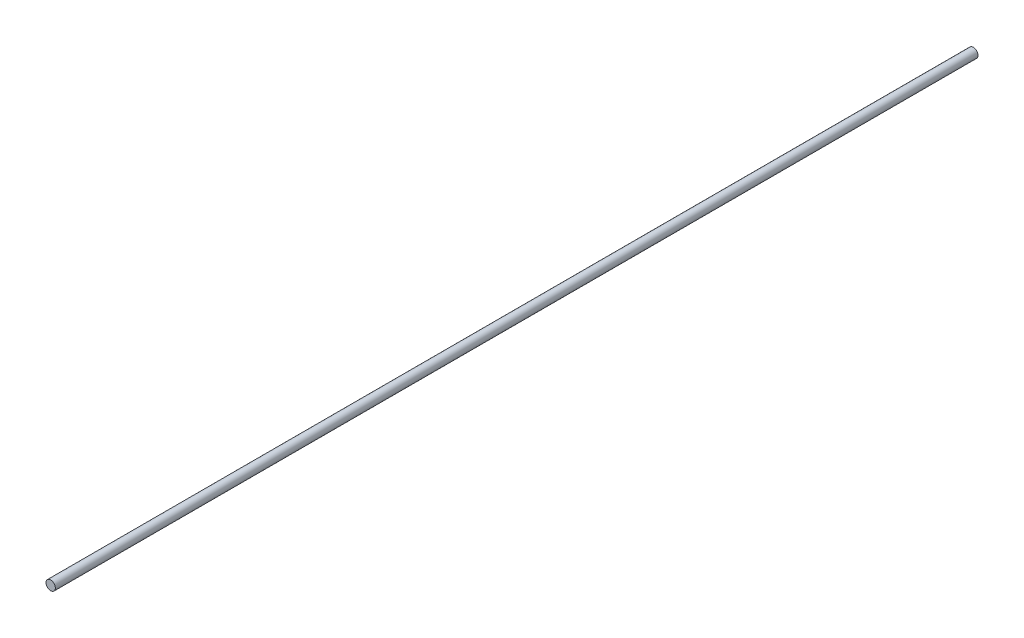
ISO-10303-21;
HEADER;
FILE_DESCRIPTION(('STEP AP214'),'2;1');
FILE_NAME('part.step','',(''),(''),'','','');
FILE_SCHEMA(('AUTOMOTIVE_DESIGN { 1 0 10303 214 1 1 1 1 }'));
ENDSEC;
DATA;
#1=APPLICATION_CONTEXT('core data for automotive mechanical design processes');
#2=APPLICATION_PROTOCOL_DEFINITION('international standard','automotive_design',2000,#1);
#3=PRODUCT_CONTEXT('',#1,'mechanical');
#4=PRODUCT('Part','Part','',(#3));
#5=PRODUCT_RELATED_PRODUCT_CATEGORY('part','',(#4));
#6=PRODUCT_DEFINITION_FORMATION('','',#4);
#7=PRODUCT_DEFINITION_CONTEXT('part definition',#1,'design');
#8=PRODUCT_DEFINITION('design','',#6,#7);
#9=PRODUCT_DEFINITION_SHAPE('','',#8);
#10=(LENGTH_UNIT() NAMED_UNIT(*) SI_UNIT(.MILLI.,.METRE.));
#11=(NAMED_UNIT(*) PLANE_ANGLE_UNIT() SI_UNIT($,.RADIAN.));
#12=(NAMED_UNIT(*) SI_UNIT($,.STERADIAN.) SOLID_ANGLE_UNIT());
#13=UNCERTAINTY_MEASURE_WITH_UNIT(LENGTH_MEASURE(1.E-05),#10,'distance_accuracy_value','');
#14=(GEOMETRIC_REPRESENTATION_CONTEXT(3) GLOBAL_UNCERTAINTY_ASSIGNED_CONTEXT((#13)) GLOBAL_UNIT_ASSIGNED_CONTEXT((#10,
#11,#12)) REPRESENTATION_CONTEXT('',''));
#15=CARTESIAN_POINT('',(0.,0.,0.));
#16=DIRECTION('',(0.,0.,1.));
#17=DIRECTION('',(1.,0.,0.));
#18=AXIS2_PLACEMENT_3D('',#15,#16,#17);
#19=CARTESIAN_POINT('',(0.,0.,-5900.));
#20=DIRECTION('',(0.,0.,1.));
#21=DIRECTION('',(1.,0.,0.));
#22=AXIS2_PLACEMENT_3D('',#19,#20,#21);
#23=CYLINDRICAL_SURFACE('',#22,30.);
#24=CARTESIAN_POINT('',(0.,0.,-5900.));
#25=DIRECTION('',(0.,0.,1.));
#26=DIRECTION('',(1.,0.,0.));
#27=AXIS2_PLACEMENT_3D('',#24,#25,#26);
#28=CIRCLE('',#27,30.);
#29=CARTESIAN_POINT('',(30.,0.,-5900.));
#30=VERTEX_POINT('',#29);
#31=EDGE_CURVE('E10',#30,#30,#28,.T.);
#32=ORIENTED_EDGE('',*,*,#31,.T.);
#33=EDGE_LOOP('',(#32));
#34=FACE_BOUND('',#33,.T.);
#35=CARTESIAN_POINT('',(0.,0.,0.));
#36=DIRECTION('',(0.,0.,1.));
#37=DIRECTION('',(1.,0.,0.));
#38=AXIS2_PLACEMENT_3D('',#35,#36,#37);
#39=CIRCLE('',#38,30.);
#40=CARTESIAN_POINT('',(30.,0.,0.));
#41=VERTEX_POINT('',#40);
#42=EDGE_CURVE('E40',#41,#41,#39,.T.);
#43=ORIENTED_EDGE('',*,*,#42,.F.);
#44=EDGE_LOOP('',(#43));
#45=FACE_BOUND('',#44,.T.);
#46=ADVANCED_FACE('F37',(#34,#45),#23,.T.);
#47=CARTESIAN_POINT('',(0.,0.,-5900.));
#48=DIRECTION('',(0.,0.,1.));
#49=DIRECTION('',(1.,0.,0.));
#50=AXIS2_PLACEMENT_3D('',#47,#48,#49);
#51=PLANE('',#50);
#52=ORIENTED_EDGE('',*,*,#31,.F.);
#53=EDGE_LOOP('',(#52));
#54=FACE_BOUND('',#53,.T.);
#55=ADVANCED_FACE('F54',(#54),#51,.F.);
#56=CARTESIAN_POINT('',(0.,0.,0.));
#57=DIRECTION('',(0.,0.,1.));
#58=DIRECTION('',(1.,0.,0.));
#59=AXIS2_PLACEMENT_3D('',#56,#57,#58);
#60=PLANE('',#59);
#61=ORIENTED_EDGE('',*,*,#42,.T.);
#62=EDGE_LOOP('',(#61));
#63=FACE_BOUND('',#62,.T.);
#64=ADVANCED_FACE('F51',(#63),#60,.T.);
#65=CLOSED_SHELL('',(#46,#55,#64));
#66=MANIFOLD_SOLID_BREP('B2',#65);
#67=ADVANCED_BREP_SHAPE_REPRESENTATION('',(#18,#66),#14);
#68=SHAPE_DEFINITION_REPRESENTATION(#9,#67);
ENDSEC;
END-ISO-10303-21;
